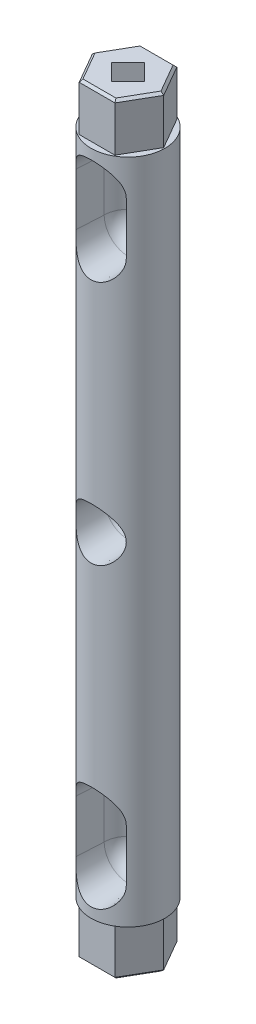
from build123d import *

# Parameters (mm, degrees)
SKETCH1_R                        = 7.75
BOSS_EXTRUDE1_DEPTH              = 140
SKETCH2_R                        = 5
CUT_EXTRUDE1_DEPTH               = 141.42836252
CUT_EXTRUDE1_TAPER               = -3
BOSS_EXTRUDE2_DEPTH              = 10
BOSS_EXTRUDE3_DEPTH              = 10
F_10_0_1935_DIAMETER_HOLE1_D     = 4.9149
F_10_0_1935_DIAMETER_HOLE1_DEPTH = 5
F_10_0_1935_DIAMETER_HOLE1_TIP   = 1.476584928
F_10_0_1935_DIAMETER_HOLE2_D     = 4.9149
F_10_0_1935_DIAMETER_HOLE2_DEPTH = 5
F_10_0_1935_DIAMETER_HOLE2_TIP   = 1.476584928
CUT_EXTRUDE2_DEPTH               = 10
CUT_EXTRUDE3_DEPTH               = 10
CHAMFER1_SIZE                    = 0.5
CHAMFER2_SIZE                    = 0.5


with BuildPart() as part:
    # Sketch1 → Boss-Extrude1 (new body)
    with BuildSketch(Plane(origin=(0, 0, 0), x_dir=(1, 0, 0), z_dir=(0, 1, 0))):
        with Locations(Location((0, 0, 0), (0, 0, 270))):
            Circle(SKETCH1_R)
    extrude(amount=BOSS_EXTRUDE1_DEPTH)

    # Sketch2 → Cut-Extrude1 (cut, through all)
    with BuildSketch(Plane.XY):
        with Locations((0, 70)):
            Circle(SKETCH2_R)
        with BuildLine():
            Line((-5, 132.5), (-5, 122.5))
            Line((-5, 122.5), (-5, 121.5))
            ThreePointArc((-5, 121.5), (0, 116.5), (5, 121.5))
            Line((5, 121.5), (5, 122.5))
            Line((5, 122.5), (5, 132.5))
            ThreePointArc((5, 132.5), (0, 137.5), (-5, 132.5))
        make_face()
        with BuildLine():
            Line((-5, 17.5), (-5, 7.5))
            ThreePointArc((-5, 7.5), (0, 2.5), (5, 7.5))
            Line((5, 7.5), (5, 17.5))
            Line((5, 17.5), (5, 18.5))
            ThreePointArc((5, 18.5), (0, 23.5), (-5, 18.5))
            Line((-5, 18.5), (-5, 17.5))
        make_face()
    extrude(amount=CUT_EXTRUDE1_DEPTH, taper=CUT_EXTRUDE1_TAPER, mode=Mode.SUBTRACT)

    # Sketch3 → Cut-Revolve1 (revolve, cut)
    with BuildSketch(Plane.XY):
        with BuildLine():
            Line((0, 75), (0, 65))
            ThreePointArc((0, 65), (5, 70), (0, 75))
        make_face()
        with BuildLine():
            Line((0, 137.5), (0, 130))
            Line((0, 130), (0, 116.5))
            ThreePointArc((0, 116.5), (3.535533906, 117.964466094), (5, 121.5))
            Line((5, 121.5), (5, 132.5))
            ThreePointArc((5, 132.5), (3.535533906, 136.035533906), (0, 137.5))
        make_face()
        with BuildLine():
            Line((0, 7.5), (0, 23.5))
            ThreePointArc((0, 23.5), (3.535533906, 22.035533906), (5, 18.5))
            Line((5, 18.5), (5, 7.5))
            ThreePointArc((5, 7.5), (3.535533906, 3.964466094), (0, 2.5))
            Line((0, 2.5), (0, 7.5))
        make_face()
    revolve(axis=Axis((0, 140, 0), (0, -1, 0)), mode=Mode.SUBTRACT)

    # Sketch4 → Boss-Extrude2 (add)
    with BuildSketch(Plane(origin=(0, 140, 0), x_dir=(1, 0, 0), z_dir=(0, 1, 0))):
        Polygon((7.5, 0), (3.75, 6.495190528), (-3.75, 6.495190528), (-7.5, 0), (-3.75, -6.495190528), (3.75, -6.495190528), align=None)
    extrude(amount=BOSS_EXTRUDE2_DEPTH)

    # Sketch5 → Boss-Extrude3 (add)
    with BuildSketch(Plane(origin=(0, 0, 0), x_dir=(-1, 0, 0), z_dir=(0, -1, 0))):
        Polygon((-7.5, 0), (-3.75, -6.495190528), (3.75, -6.495190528), (7.5, 0), (3.75, 6.495190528), (-3.75, 6.495190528), align=None)
    extrude(amount=BOSS_EXTRUDE3_DEPTH)

    # 10 _0.1935_ Diameter Hole1
    with Locations(Plane(origin=(0, 150, 0), x_dir=(1, 0, 0), z_dir=(0, 1, 0))):
        with Locations((0, 0)):
            Hole(F_10_0_1935_DIAMETER_HOLE1_D / 2, depth=F_10_0_1935_DIAMETER_HOLE1_DEPTH)
            with Locations((0, 0, -(F_10_0_1935_DIAMETER_HOLE1_DEPTH + F_10_0_1935_DIAMETER_HOLE1_TIP / 2))):  # 118° drill point
                Cone(0, F_10_0_1935_DIAMETER_HOLE1_D / 2, F_10_0_1935_DIAMETER_HOLE1_TIP, mode=Mode.SUBTRACT)

    # 10 _0.1935_ Diameter Hole2
    with Locations(Plane(origin=(0, -10, 0), x_dir=(-1, 0, 0), z_dir=(0, -1, 0))):
        with Locations((0, 0)):
            Hole(F_10_0_1935_DIAMETER_HOLE2_D / 2, depth=F_10_0_1935_DIAMETER_HOLE2_DEPTH)
            with Locations((0, 0, -(F_10_0_1935_DIAMETER_HOLE2_DEPTH + F_10_0_1935_DIAMETER_HOLE2_TIP / 2))):  # 118° drill point
                Cone(0, F_10_0_1935_DIAMETER_HOLE2_D / 2, F_10_0_1935_DIAMETER_HOLE2_TIP, mode=Mode.SUBTRACT)

    # Sketch11 → Cut-Extrude2 (cut)
    with BuildSketch(Plane(origin=(0, 150, 0), x_dir=(1, 0, 0), z_dir=(0, 1, 0))):
        Polygon((0, 3.487644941), (3.487644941, 0), (0, -3.487644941), (-3.487644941, 0), align=None)
    extrude(amount=-CUT_EXTRUDE2_DEPTH, mode=Mode.SUBTRACT)

    # Sketch12 → Cut-Extrude3 (cut)
    with BuildSketch(Plane(origin=(0, -10, 0), x_dir=(-1, 0, 0), z_dir=(0, -1, 0))):
        Polygon((0, -3.487644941), (-3.487644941, 0), (0, 3.487644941), (3.487644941, 0), align=None)
    extrude(amount=-CUT_EXTRUDE3_DEPTH, mode=Mode.SUBTRACT)

    # Chamfer1
    chamfer1_edges = [part.edges().sort_by_distance(p)[0] for p in [
        (5.625, 150, 3.247595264),
        (5.625, 150, -3.247595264),
        (0, 150, -6.495190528),
        (-5.625, 150, -3.247595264),
        (-5.625, 150, 3.247595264),
        (0, 150, 6.495190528),
    ]]
    chamfer(chamfer1_edges, length=CHAMFER1_SIZE)

    # Chamfer2
    chamfer2_edges = [part.edges().sort_by_distance(p)[0] for p in [
        (5.625, -10, -3.247595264),
        (5.625, -10, 3.247595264),
        (0, -10, 6.495190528),
        (-5.625, -10, 3.247595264),
        (-5.625, -10, -3.247595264),
        (0, -10, -6.495190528),
    ]]
    chamfer(chamfer2_edges, length=CHAMFER2_SIZE)


solid = part.part
